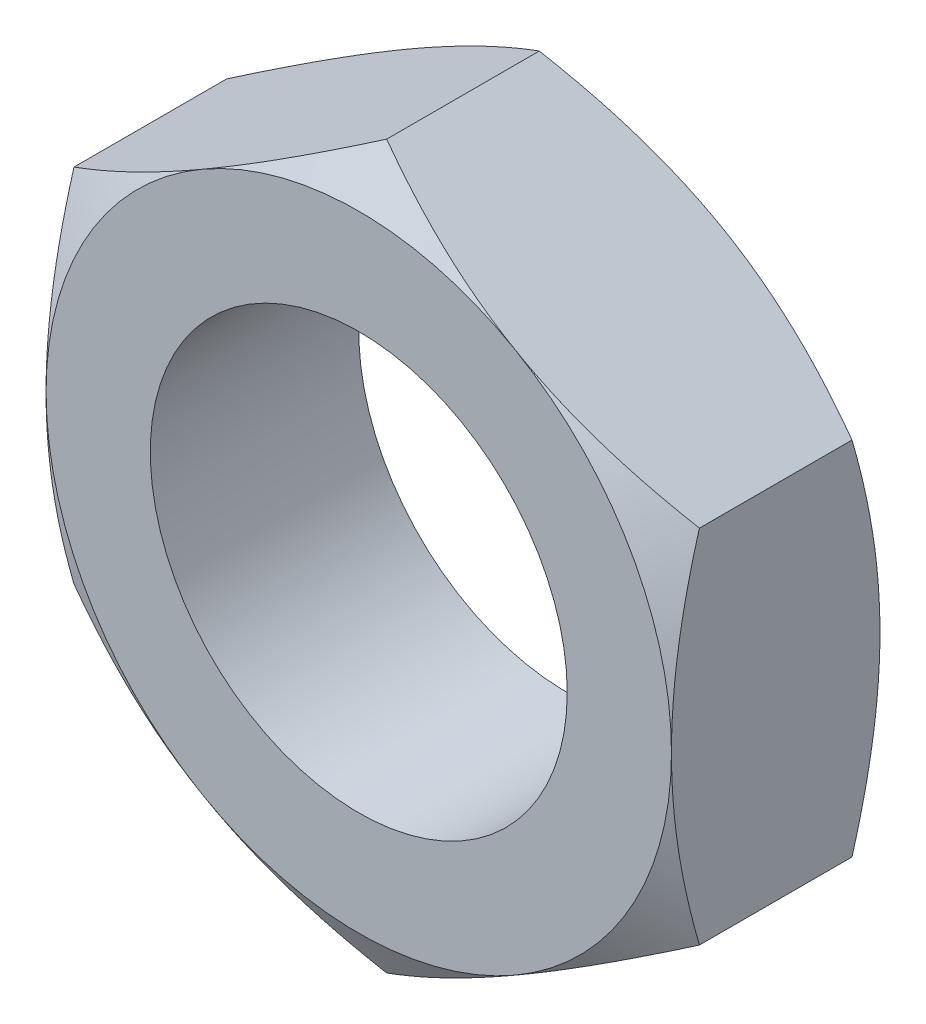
from build123d import *

# Parameters (mm, degrees)
BASE_EXTRUSION_DEPTH    = 10
ESQUISSE3_R             = 10
ENL_V_MAT_EXTRU_1_DEPTH = 26


with BuildPart() as part:
    # Esquisse1 → Base-Extrusion (new body)
    with BuildSketch(Plane.XY):
        Polygon((15, -8.660254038), (15, 8.660254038), (0, 17.320508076), (-15, 8.660254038), (-15, -8.660254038), (0, -17.320508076), align=None)
    extrude(amount=-BASE_EXTRUSION_DEPTH)

    # Esquisse2 → Enl_vement de mati_re-R_volution1 (revolve, cut)
    with BuildSketch(Plane(origin=(0, 0, 0), x_dir=(1, 0, 0), z_dir=(0, 1, 0)), mode=Mode.PRIVATE) as enl_vement_de_mati_re_r_volution1_sk:
        Polygon((-15, 0), (-24.660254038, 0), (-24.660254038, 10), (-15, 10), (-23.660254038, 5), align=None)
    revolve(enl_vement_de_mati_re_r_volution1_sk.sketch.rotate(Axis((0, 0, -10), (0, 0, 1)), 180), axis=Axis((0, 0, -10), (0, 0, 1)), mode=Mode.SUBTRACT)

    # Esquisse3 → Enl_v. mat.-Extru.1 (cut, through all)
    with BuildSketch(Plane.XY):
        Circle(ESQUISSE3_R)
    extrude(amount=-ENL_V_MAT_EXTRU_1_DEPTH, mode=Mode.SUBTRACT)


solid = part.part
